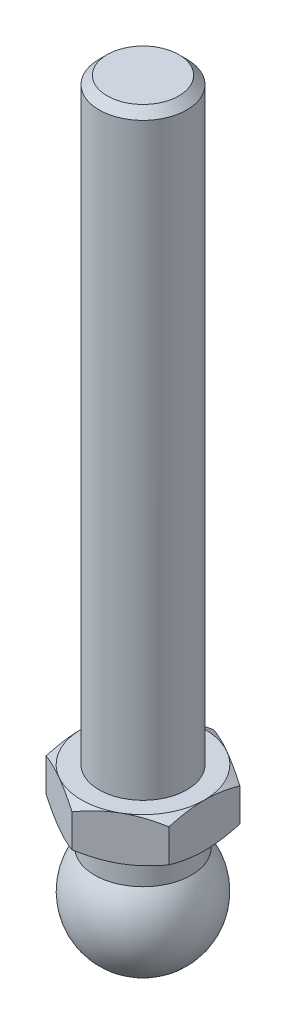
ISO-10303-21;
HEADER;
FILE_DESCRIPTION(('STEP AP214'),'2;1');
FILE_NAME('part.step','',(''),(''),'','','');
FILE_SCHEMA(('AUTOMOTIVE_DESIGN { 1 0 10303 214 1 1 1 1 }'));
ENDSEC;
DATA;
#1=APPLICATION_CONTEXT('core data for automotive mechanical design processes');
#2=APPLICATION_PROTOCOL_DEFINITION('international standard','automotive_design',2000,#1);
#3=PRODUCT_CONTEXT('',#1,'mechanical');
#4=PRODUCT('Part','Part','',(#3));
#5=PRODUCT_RELATED_PRODUCT_CATEGORY('part','',(#4));
#6=PRODUCT_DEFINITION_FORMATION('','',#4);
#7=PRODUCT_DEFINITION_CONTEXT('part definition',#1,'design');
#8=PRODUCT_DEFINITION('design','',#6,#7);
#9=PRODUCT_DEFINITION_SHAPE('','',#8);
#10=(LENGTH_UNIT() NAMED_UNIT(*) SI_UNIT(.MILLI.,.METRE.));
#11=(NAMED_UNIT(*) PLANE_ANGLE_UNIT() SI_UNIT($,.RADIAN.));
#12=(NAMED_UNIT(*) SI_UNIT($,.STERADIAN.) SOLID_ANGLE_UNIT());
#13=UNCERTAINTY_MEASURE_WITH_UNIT(LENGTH_MEASURE(1.E-05),#10,'distance_accuracy_value','');
#14=(GEOMETRIC_REPRESENTATION_CONTEXT(3) GLOBAL_UNCERTAINTY_ASSIGNED_CONTEXT((#13)) GLOBAL_UNIT_ASSIGNED_CONTEXT((#10,
#11,#12)) REPRESENTATION_CONTEXT('',''));
#15=CARTESIAN_POINT('',(0.,0.,0.));
#16=DIRECTION('',(0.,0.,1.));
#17=DIRECTION('',(1.,0.,0.));
#18=AXIS2_PLACEMENT_3D('',#15,#16,#17);
#19=CARTESIAN_POINT('',(0.,19.5,0.));
#20=DIRECTION('',(0.,-1.,0.));
#21=DIRECTION('',(0.,0.,-1.));
#22=AXIS2_PLACEMENT_3D('',#19,#20,#21);
#23=CONICAL_SURFACE('',#22,7.,1.0471975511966);
#24=CARTESIAN_POINT('',(-7.,15.2688336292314,12.5023453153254));
#25=CARTESIAN_POINT('',(-7.,15.4184696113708,12.2052647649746));
#26=CARTESIAN_POINT('',(-7.,15.5671267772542,11.9076861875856));
#27=CARTESIAN_POINT('',(-7.,15.8620076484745,11.3113035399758));
#28=CARTESIAN_POINT('',(-7.,16.0082312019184,11.0124993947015));
#29=CARTESIAN_POINT('',(-7.,16.2980281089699,10.4128982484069));
#30=CARTESIAN_POINT('',(-7.,16.441595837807,10.1120985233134));
#31=CARTESIAN_POINT('',(-7.,16.7251296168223,9.50881013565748));
#32=CARTESIAN_POINT('',(-7.,16.8650957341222,9.20632150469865));
#33=CARTESIAN_POINT('',(-7.,17.1470427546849,8.58510325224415));
#34=CARTESIAN_POINT('',(-7.,17.2888108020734,8.26627671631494));
#35=CARTESIAN_POINT('',(-7.,17.5662200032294,7.62594250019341));
#36=CARTESIAN_POINT('',(-7.,17.7018608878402,7.30443470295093));
#37=CARTESIAN_POINT('',(-7.,17.9652496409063,6.65840905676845));
#38=CARTESIAN_POINT('',(-7.,18.0930022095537,6.33389313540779));
#39=CARTESIAN_POINT('',(-7.,18.3384540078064,5.68109770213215));
#40=CARTESIAN_POINT('',(-7.,18.4561543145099,5.35281859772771));
#41=CARTESIAN_POINT('',(-7.,18.7028165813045,4.61998548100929));
#42=CARTESIAN_POINT('',(-7.,18.8286623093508,4.21436746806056));
#43=CARTESIAN_POINT('',(-7.,19.0543524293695,3.39574912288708));
#44=CARTESIAN_POINT('',(-7.,19.1541980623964,2.98274914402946));
#45=CARTESIAN_POINT('',(-7.,19.2776062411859,2.36178861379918));
#46=CARTESIAN_POINT('',(-7.,19.3141378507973,2.15638627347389));
#47=CARTESIAN_POINT('',(-7.,19.3780104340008,1.74416917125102));
#48=CARTESIAN_POINT('',(-7.,19.4053527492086,1.53735462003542));
#49=CARTESIAN_POINT('',(-7.,19.4500375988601,1.1227076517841));
#50=CARTESIAN_POINT('',(-7.,19.467383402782,0.914875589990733));
#51=CARTESIAN_POINT('',(-7.,19.4915250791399,0.498594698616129));
#52=CARTESIAN_POINT('',(-7.,19.4983210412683,0.290145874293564));
#53=CARTESIAN_POINT('',(-7.,19.5011397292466,-0.128421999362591));
#54=CARTESIAN_POINT('',(-7.,19.4970795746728,-0.338541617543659));
#55=CARTESIAN_POINT('',(-7.,19.4781521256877,-0.758289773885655));
#56=CARTESIAN_POINT('',(-7.,19.463284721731,-0.967918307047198));
#57=CARTESIAN_POINT('',(-7.,19.4232345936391,-1.38625975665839));
#58=CARTESIAN_POINT('',(-7.,19.3980479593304,-1.59497229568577));
#59=CARTESIAN_POINT('',(-7.,19.3381380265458,-2.01100790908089));
#60=CARTESIAN_POINT('',(-7.,19.3034145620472,-2.21833095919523));
#61=CARTESIAN_POINT('',(-7.,19.1849408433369,-2.84522045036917));
#62=CARTESIAN_POINT('',(-7.,19.0876569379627,-3.26225118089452));
#63=CARTESIAN_POINT('',(-7.,18.8658468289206,-4.08879182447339));
#64=CARTESIAN_POINT('',(-7.,18.7413180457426,-4.4983010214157));
#65=CARTESIAN_POINT('',(-7.,18.4953846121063,-5.2406101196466));
#66=CARTESIAN_POINT('',(-7.,18.3771372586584,-5.5744719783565));
#67=CARTESIAN_POINT('',(-7.,18.1300009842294,-6.23825206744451));
#68=CARTESIAN_POINT('',(-7.,18.0011107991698,-6.56816982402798));
#69=CARTESIAN_POINT('',(-7.,17.7350197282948,-7.22486424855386));
#70=CARTESIAN_POINT('',(-7.,17.5978135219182,-7.55163874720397));
#71=CARTESIAN_POINT('',(-7.,17.3169731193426,-8.20238370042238));
#72=CARTESIAN_POINT('',(-7.,17.1733392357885,-8.5263542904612));
#73=CARTESIAN_POINT('',(-7.,16.8876445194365,-9.15729037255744));
#74=CARTESIAN_POINT('',(-7.,16.7458097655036,-9.46435857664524));
#75=CARTESIAN_POINT('',(-7.,16.4583976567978,-10.0767426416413));
#76=CARTESIAN_POINT('',(-7.,16.3128202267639,-10.3820584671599));
#77=CARTESIAN_POINT('',(-7.,16.018926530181,-10.990585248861));
#78=CARTESIAN_POINT('',(-7.,15.8706165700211,-11.2937992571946));
#79=CARTESIAN_POINT('',(-7.,15.5714843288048,-11.8989613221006));
#80=CARTESIAN_POINT('',(-7.,15.4206622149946,-12.2009094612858));
#81=CARTESIAN_POINT('',(-7.,15.2688336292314,-12.5023453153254));
#82=B_SPLINE_CURVE_WITH_KNOTS('',3,(#24,#25,#26,#27,#28,#29,#30,#31,#32,#33,#34,#35,#36,#37,#38,
#39,#40,#41,#42,#43,#44,#45,#46,#47,#48,#49,#50,#51,#52,#53,#54,#55,#56,#57,#58,#59,#60,#61,#62,
#63,#64,#65,#66,#67,#68,#69,#70,#71,#72,#73,#74,#75,#76,#77,#78,#79,#80,#81),.UNSPECIFIED.,.F.,
.F.,(4,2,2,2,2,2,2,2,2,2,2,2,2,2,2,2,2,2,2,2,2,2,2,2,2,2,2,2,4),(0.,0.997917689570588,
1.99589743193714,2.99579247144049,3.99566886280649,5.04239250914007,6.08916209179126,
7.13530182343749,8.18132932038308,9.45480706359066,10.7282240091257,11.3539282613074,
11.9795411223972,12.6049492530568,13.2303520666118,13.8605430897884,14.490740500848,
15.1211769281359,15.7516243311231,17.0349275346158,18.3183522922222,19.380686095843,
20.4431462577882,21.506293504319,22.5693890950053,23.5840866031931,24.5988045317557,
25.6114179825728,26.6239642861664),.UNSPECIFIED.);
#83=CARTESIAN_POINT('',(-7.,18.8747852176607,4.04145188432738));
#84=VERTEX_POINT('',#83);
#85=CARTESIAN_POINT('',(-7.,19.5,0.));
#86=VERTEX_POINT('',#85);
#87=EDGE_CURVE('E359',#84,#86,#82,.T.);
#88=ORIENTED_EDGE('',*,*,#87,.F.);
#89=CARTESIAN_POINT('',(0.0002,18.8747185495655,8.0830192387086));
#90=CARTESIAN_POINT('',(-0.153667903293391,18.9260001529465,7.99418356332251));
#91=CARTESIAN_POINT('',(-0.30810950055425,18.9749544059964,7.90501666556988));
#92=CARTESIAN_POINT('',(-0.618246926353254,19.0675672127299,7.72595873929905));
#93=CARTESIAN_POINT('',(-0.773943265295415,19.1112234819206,7.63606741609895));
#94=CARTESIAN_POINT('',(-1.24352516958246,19.2333884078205,7.36495417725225));
#95=CARTESIAN_POINT('',(-1.5592643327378,19.302874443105,7.18266208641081));
#96=CARTESIAN_POINT('',(-2.03176224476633,19.3843550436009,6.9098652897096));
#97=CARTESIAN_POINT('',(-2.18710922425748,19.4075665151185,6.82017566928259));
#98=CARTESIAN_POINT('',(-2.49850511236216,19.4464887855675,6.64039116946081));
#99=CARTESIAN_POINT('',(-2.65455395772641,19.4622002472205,6.55029632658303));
#100=CARTESIAN_POINT('',(-2.96692267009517,19.4857220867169,6.36995016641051));
#101=CARTESIAN_POINT('',(-3.12324202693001,19.4935414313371,6.27969914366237));
#102=CARTESIAN_POINT('',(-3.43601650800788,19.5011197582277,6.09911871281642));
#103=CARTESIAN_POINT('',(-3.59247162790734,19.500878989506,6.00878930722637));
#104=CARTESIAN_POINT('',(-4.02110687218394,19.4891402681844,5.76131663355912));
#105=CARTESIAN_POINT('',(-4.2931466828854,19.4694342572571,5.60425437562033));
#106=CARTESIAN_POINT('',(-4.83541944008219,19.4069465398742,5.29117305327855));
#107=CARTESIAN_POINT('',(-5.10565047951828,19.364143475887,5.13515508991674));
#108=CARTESIAN_POINT('',(-5.64901454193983,19.2571483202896,4.82144370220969));
#109=CARTESIAN_POINT('',(-5.92207900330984,19.1925029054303,4.66378986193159));
#110=CARTESIAN_POINT('',(-6.46413578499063,19.045783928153,4.35083323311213));
#111=CARTESIAN_POINT('',(-6.73313504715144,18.9637448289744,4.19552643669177));
#112=CARTESIAN_POINT('',(-7.0002,18.8747185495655,4.04133641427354));
#113=B_SPLINE_CURVE_WITH_KNOTS('',3,(#89,#90,#91,#92,#93,#94,#95,#96,#97,#98,#99,#100,#101,#102,
#103,#104,#105,#106,#107,#108,#109,#110,#111,#112),.UNSPECIFIED.,.F.,.F.,(4,2,2,2,2,2,2,2,2,2,2,
4),(0.,0.554727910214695,1.10969417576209,2.2219327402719,2.76443041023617,3.30688013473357,
3.8487128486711,4.39052882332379,5.33376515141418,6.27787517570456,7.2429241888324,
8.20607866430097),.UNSPECIFIED.);
#114=CARTESIAN_POINT('',(-3.5,19.5,6.06217782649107));
#115=VERTEX_POINT('',#114);
#116=EDGE_CURVE('E148',#115,#84,#113,.T.);
#117=ORIENTED_EDGE('',*,*,#116,.F.);
#118=CARTESIAN_POINT('',(0.,19.5,0.));
#119=DIRECTION('',(0.,-1.,0.));
#120=DIRECTION('',(0.,0.,-1.));
#121=AXIS2_PLACEMENT_3D('',#118,#119,#120);
#122=CIRCLE('',#121,7.);
#123=EDGE_CURVE('E317',#115,#86,#122,.T.);
#124=ORIENTED_EDGE('',*,*,#123,.T.);
#125=EDGE_LOOP('',(#88,#117,#124));
#126=FACE_BOUND('',#125,.T.);
#127=ADVANCED_FACE('F18',(#126),#23,.T.);
#128=CARTESIAN_POINT('',(-7.,18.8747852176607,-4.04145188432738));
#129=VERTEX_POINT('',#128);
#130=EDGE_CURVE('E213',#86,#129,#82,.T.);
#131=ORIENTED_EDGE('',*,*,#130,.F.);
#132=CARTESIAN_POINT('',(-3.5,19.5,-6.06217782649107));
#133=VERTEX_POINT('',#132);
#134=EDGE_CURVE('E340',#86,#133,#122,.T.);
#135=ORIENTED_EDGE('',*,*,#134,.T.);
#136=CARTESIAN_POINT('',(-7.0002,18.8747185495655,-4.04133641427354));
#137=CARTESIAN_POINT('',(-6.84633209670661,18.9260001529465,-4.13017208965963));
#138=CARTESIAN_POINT('',(-6.69189049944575,18.9749544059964,-4.21933898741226));
#139=CARTESIAN_POINT('',(-6.38175307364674,19.0675672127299,-4.39839691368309));
#140=CARTESIAN_POINT('',(-6.22605673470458,19.1112234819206,-4.48828823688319));
#141=CARTESIAN_POINT('',(-5.75647483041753,19.2333884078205,-4.75940147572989));
#142=CARTESIAN_POINT('',(-5.4407356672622,19.302874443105,-4.94169356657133));
#143=CARTESIAN_POINT('',(-4.96823775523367,19.3843550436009,-5.21449036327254));
#144=CARTESIAN_POINT('',(-4.81289077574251,19.4075665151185,-5.30417998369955));
#145=CARTESIAN_POINT('',(-4.50149488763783,19.4464887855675,-5.48396448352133));
#146=CARTESIAN_POINT('',(-4.34544604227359,19.4622002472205,-5.57405932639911));
#147=CARTESIAN_POINT('',(-4.03307732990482,19.4857220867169,-5.75440548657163));
#148=CARTESIAN_POINT('',(-3.87675797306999,19.4935414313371,-5.84465650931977));
#149=CARTESIAN_POINT('',(-3.56398349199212,19.5011197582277,-6.02523694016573));
#150=CARTESIAN_POINT('',(-3.40752837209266,19.500878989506,-6.11556634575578));
#151=CARTESIAN_POINT('',(-2.97889312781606,19.4891402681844,-6.36303901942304));
#152=CARTESIAN_POINT('',(-2.7068533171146,19.4694342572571,-6.52010127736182));
#153=CARTESIAN_POINT('',(-2.1645805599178,19.4069465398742,-6.83318259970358));
#154=CARTESIAN_POINT('',(-1.89434952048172,19.364143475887,-6.9892005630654));
#155=CARTESIAN_POINT('',(-1.35098545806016,19.2571483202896,-7.30291195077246));
#156=CARTESIAN_POINT('',(-1.07792099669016,19.1925029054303,-7.46056579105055));
#157=CARTESIAN_POINT('',(-0.53586421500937,19.045783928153,-7.77352241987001));
#158=CARTESIAN_POINT('',(-0.26686495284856,18.9637448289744,-7.92882921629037));
#159=CARTESIAN_POINT('',(0.000200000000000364,18.8747185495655,-8.0830192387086));
#160=B_SPLINE_CURVE_WITH_KNOTS('',3,(#136,#137,#138,#139,#140,#141,#142,#143,#144,#145,#146,
#147,#148,#149,#150,#151,#152,#153,#154,#155,#156,#157,#158,#159),.UNSPECIFIED.,.F.,.F.,(4,2,2,
2,2,2,2,2,2,2,2,4),(0.,0.554727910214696,1.10969417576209,2.2219327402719,2.76443041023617,
3.30688013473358,3.8487128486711,4.39052882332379,5.33376515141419,6.27787517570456,
7.2429241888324,8.20607866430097),.UNSPECIFIED.);
#161=EDGE_CURVE('E205',#129,#133,#160,.T.);
#162=ORIENTED_EDGE('',*,*,#161,.F.);
#163=EDGE_LOOP('',(#131,#135,#162));
#164=FACE_BOUND('',#163,.T.);
#165=ADVANCED_FACE('F406',(#164),#23,.T.);
#166=CARTESIAN_POINT('',(0.,18.8747852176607,-8.08290376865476));
#167=VERTEX_POINT('',#166);
#168=EDGE_CURVE('E206',#133,#167,#160,.T.);
#169=ORIENTED_EDGE('',*,*,#168,.F.);
#170=CARTESIAN_POINT('',(3.5,19.5,-6.06217782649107));
#171=VERTEX_POINT('',#170);
#172=EDGE_CURVE('E331',#133,#171,#122,.T.);
#173=ORIENTED_EDGE('',*,*,#172,.T.);
#174=CARTESIAN_POINT('',(-0.0002,18.8747185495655,-8.0830192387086));
#175=CARTESIAN_POINT('',(0.153667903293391,18.9260001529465,-7.99418356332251));
#176=CARTESIAN_POINT('',(0.30810950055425,18.9749544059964,-7.90501666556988));
#177=CARTESIAN_POINT('',(0.618246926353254,19.0675672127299,-7.72595873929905));
#178=CARTESIAN_POINT('',(0.773943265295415,19.1112234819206,-7.63606741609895));
#179=CARTESIAN_POINT('',(1.24352516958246,19.2333884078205,-7.36495417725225));
#180=CARTESIAN_POINT('',(1.5592643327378,19.302874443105,-7.18266208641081));
#181=CARTESIAN_POINT('',(2.03176224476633,19.3843550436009,-6.9098652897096));
#182=CARTESIAN_POINT('',(2.18710922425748,19.4075665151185,-6.82017566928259));
#183=CARTESIAN_POINT('',(2.49850511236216,19.4464887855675,-6.64039116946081));
#184=CARTESIAN_POINT('',(2.65455395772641,19.4622002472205,-6.55029632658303));
#185=CARTESIAN_POINT('',(2.96692267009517,19.4857220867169,-6.36995016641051));
#186=CARTESIAN_POINT('',(3.12324202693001,19.4935414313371,-6.27969914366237));
#187=CARTESIAN_POINT('',(3.43601650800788,19.5011197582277,-6.09911871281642));
#188=CARTESIAN_POINT('',(3.59247162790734,19.500878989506,-6.00878930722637));
#189=CARTESIAN_POINT('',(4.02110687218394,19.4891402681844,-5.76131663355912));
#190=CARTESIAN_POINT('',(4.2931466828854,19.4694342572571,-5.60425437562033));
#191=CARTESIAN_POINT('',(4.83541944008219,19.4069465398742,-5.29117305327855));
#192=CARTESIAN_POINT('',(5.10565047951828,19.364143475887,-5.13515508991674));
#193=CARTESIAN_POINT('',(5.64901454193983,19.2571483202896,-4.82144370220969));
#194=CARTESIAN_POINT('',(5.92207900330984,19.1925029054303,-4.66378986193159));
#195=CARTESIAN_POINT('',(6.46413578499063,19.045783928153,-4.35083323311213));
#196=CARTESIAN_POINT('',(6.73313504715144,18.9637448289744,-4.19552643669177));
#197=CARTESIAN_POINT('',(7.0002,18.8747185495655,-4.04133641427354));
#198=B_SPLINE_CURVE_WITH_KNOTS('',3,(#174,#175,#176,#177,#178,#179,#180,#181,#182,#183,#184,
#185,#186,#187,#188,#189,#190,#191,#192,#193,#194,#195,#196,#197),.UNSPECIFIED.,.F.,.F.,(4,2,2,
2,2,2,2,2,2,2,2,4),(0.,0.554727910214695,1.10969417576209,2.2219327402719,2.76443041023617,
3.30688013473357,3.8487128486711,4.39052882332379,5.33376515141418,6.27787517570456,
7.2429241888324,8.20607866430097),.UNSPECIFIED.);
#199=EDGE_CURVE('E247',#167,#171,#198,.T.);
#200=ORIENTED_EDGE('',*,*,#199,.F.);
#201=EDGE_LOOP('',(#169,#173,#200));
#202=FACE_BOUND('',#201,.T.);
#203=ADVANCED_FACE('F412',(#202),#23,.T.);
#204=CARTESIAN_POINT('',(7.,18.8747852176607,-4.04145188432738));
#205=VERTEX_POINT('',#204);
#206=EDGE_CURVE('E248',#171,#205,#198,.T.);
#207=ORIENTED_EDGE('',*,*,#206,.F.);
#208=CARTESIAN_POINT('',(7.,19.5,0.));
#209=VERTEX_POINT('',#208);
#210=EDGE_CURVE('E324',#171,#209,#122,.T.);
#211=ORIENTED_EDGE('',*,*,#210,.T.);
#212=CARTESIAN_POINT('',(7.,15.2688336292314,-12.5023453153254));
#213=CARTESIAN_POINT('',(7.,15.4184696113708,-12.2052647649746));
#214=CARTESIAN_POINT('',(7.,15.5671267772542,-11.9076861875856));
#215=CARTESIAN_POINT('',(7.,15.8620076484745,-11.3113035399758));
#216=CARTESIAN_POINT('',(7.,16.0082312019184,-11.0124993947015));
#217=CARTESIAN_POINT('',(7.,16.2980281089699,-10.4128982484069));
#218=CARTESIAN_POINT('',(7.,16.441595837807,-10.1120985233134));
#219=CARTESIAN_POINT('',(7.,16.7251296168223,-9.50881013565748));
#220=CARTESIAN_POINT('',(7.,16.8650957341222,-9.20632150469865));
#221=CARTESIAN_POINT('',(7.,17.1470427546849,-8.58510325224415));
#222=CARTESIAN_POINT('',(7.,17.2888108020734,-8.26627671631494));
#223=CARTESIAN_POINT('',(7.,17.5662200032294,-7.62594250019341));
#224=CARTESIAN_POINT('',(7.,17.7018608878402,-7.30443470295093));
#225=CARTESIAN_POINT('',(7.,17.9652496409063,-6.65840905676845));
#226=CARTESIAN_POINT('',(7.,18.0930022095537,-6.33389313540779));
#227=CARTESIAN_POINT('',(7.,18.3384540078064,-5.68109770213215));
#228=CARTESIAN_POINT('',(7.,18.4561543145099,-5.35281859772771));
#229=CARTESIAN_POINT('',(7.,18.7028165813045,-4.61998548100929));
#230=CARTESIAN_POINT('',(7.,18.8286623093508,-4.21436746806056));
#231=CARTESIAN_POINT('',(7.,19.0543524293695,-3.39574912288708));
#232=CARTESIAN_POINT('',(7.,19.1541980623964,-2.98274914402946));
#233=CARTESIAN_POINT('',(7.,19.2776062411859,-2.36178861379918));
#234=CARTESIAN_POINT('',(7.,19.3141378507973,-2.15638627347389));
#235=CARTESIAN_POINT('',(7.,19.3780104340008,-1.74416917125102));
#236=CARTESIAN_POINT('',(7.,19.4053527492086,-1.53735462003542));
#237=CARTESIAN_POINT('',(7.,19.4500375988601,-1.1227076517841));
#238=CARTESIAN_POINT('',(7.,19.467383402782,-0.914875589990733));
#239=CARTESIAN_POINT('',(7.,19.4915250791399,-0.498594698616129));
#240=CARTESIAN_POINT('',(7.,19.4983210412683,-0.290145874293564));
#241=CARTESIAN_POINT('',(7.,19.5011397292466,0.128421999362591));
#242=CARTESIAN_POINT('',(7.,19.4970795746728,0.338541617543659));
#243=CARTESIAN_POINT('',(7.,19.4781521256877,0.758289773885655));
#244=CARTESIAN_POINT('',(7.,19.463284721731,0.967918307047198));
#245=CARTESIAN_POINT('',(7.,19.4232345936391,1.38625975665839));
#246=CARTESIAN_POINT('',(7.,19.3980479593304,1.59497229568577));
#247=CARTESIAN_POINT('',(7.,19.3381380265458,2.01100790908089));
#248=CARTESIAN_POINT('',(7.,19.3034145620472,2.21833095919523));
#249=CARTESIAN_POINT('',(7.,19.1849408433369,2.84522045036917));
#250=CARTESIAN_POINT('',(7.,19.0876569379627,3.26225118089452));
#251=CARTESIAN_POINT('',(7.,18.8658468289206,4.08879182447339));
#252=CARTESIAN_POINT('',(7.,18.7413180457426,4.4983010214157));
#253=CARTESIAN_POINT('',(7.,18.4953846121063,5.2406101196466));
#254=CARTESIAN_POINT('',(7.,18.3771372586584,5.5744719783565));
#255=CARTESIAN_POINT('',(7.,18.1300009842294,6.23825206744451));
#256=CARTESIAN_POINT('',(7.,18.0011107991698,6.56816982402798));
#257=CARTESIAN_POINT('',(7.,17.7350197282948,7.22486424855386));
#258=CARTESIAN_POINT('',(7.,17.5978135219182,7.55163874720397));
#259=CARTESIAN_POINT('',(7.,17.3169731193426,8.20238370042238));
#260=CARTESIAN_POINT('',(7.,17.1733392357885,8.5263542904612));
#261=CARTESIAN_POINT('',(7.,16.8876445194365,9.15729037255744));
#262=CARTESIAN_POINT('',(7.,16.7458097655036,9.46435857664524));
#263=CARTESIAN_POINT('',(7.,16.4583976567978,10.0767426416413));
#264=CARTESIAN_POINT('',(7.,16.3128202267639,10.3820584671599));
#265=CARTESIAN_POINT('',(7.,16.018926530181,10.990585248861));
#266=CARTESIAN_POINT('',(7.,15.8706165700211,11.2937992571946));
#267=CARTESIAN_POINT('',(7.,15.5714843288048,11.8989613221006));
#268=CARTESIAN_POINT('',(7.,15.4206622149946,12.2009094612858));
#269=CARTESIAN_POINT('',(7.,15.2688336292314,12.5023453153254));
#270=B_SPLINE_CURVE_WITH_KNOTS('',3,(#212,#213,#214,#215,#216,#217,#218,#219,#220,#221,#222,
#223,#224,#225,#226,#227,#228,#229,#230,#231,#232,#233,#234,#235,#236,#237,#238,#239,#240,#241,
#242,#243,#244,#245,#246,#247,#248,#249,#250,#251,#252,#253,#254,#255,#256,#257,#258,#259,#260,
#261,#262,#263,#264,#265,#266,#267,#268,#269),.UNSPECIFIED.,.F.,.F.,(4,2,2,2,2,2,2,2,2,2,2,2,2,
2,2,2,2,2,2,2,2,2,2,2,2,2,2,2,4),(0.,0.997917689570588,1.99589743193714,2.99579247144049,
3.99566886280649,5.04239250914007,6.08916209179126,7.13530182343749,8.18132932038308,
9.45480706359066,10.7282240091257,11.3539282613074,11.9795411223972,12.6049492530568,
13.2303520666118,13.8605430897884,14.490740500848,15.1211769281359,15.7516243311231,
17.0349275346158,18.3183522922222,19.380686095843,20.4431462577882,21.506293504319,
22.5693890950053,23.5840866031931,24.5988045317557,25.6114179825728,26.6239642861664),.UNSPECIFIED.);
#271=EDGE_CURVE('E270',#205,#209,#270,.T.);
#272=ORIENTED_EDGE('',*,*,#271,.F.);
#273=EDGE_LOOP('',(#207,#211,#272));
#274=FACE_BOUND('',#273,.T.);
#275=ADVANCED_FACE('F422',(#274),#23,.T.);
#276=CARTESIAN_POINT('',(7.,18.8747852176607,4.04145188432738));
#277=VERTEX_POINT('',#276);
#278=EDGE_CURVE('E271',#209,#277,#270,.T.);
#279=ORIENTED_EDGE('',*,*,#278,.F.);
#280=CARTESIAN_POINT('',(3.5,19.5,6.06217782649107));
#281=VERTEX_POINT('',#280);
#282=EDGE_CURVE('E314',#209,#281,#122,.T.);
#283=ORIENTED_EDGE('',*,*,#282,.T.);
#284=CARTESIAN_POINT('',(7.0002,18.8747185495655,4.04133641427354));
#285=CARTESIAN_POINT('',(6.84633209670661,18.9260001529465,4.13017208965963));
#286=CARTESIAN_POINT('',(6.69189049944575,18.9749544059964,4.21933898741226));
#287=CARTESIAN_POINT('',(6.38175307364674,19.0675672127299,4.39839691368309));
#288=CARTESIAN_POINT('',(6.22605673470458,19.1112234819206,4.48828823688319));
#289=CARTESIAN_POINT('',(5.75647483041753,19.2333884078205,4.75940147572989));
#290=CARTESIAN_POINT('',(5.4407356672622,19.302874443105,4.94169356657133));
#291=CARTESIAN_POINT('',(4.96823775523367,19.3843550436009,5.21449036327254));
#292=CARTESIAN_POINT('',(4.81289077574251,19.4075665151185,5.30417998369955));
#293=CARTESIAN_POINT('',(4.50149488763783,19.4464887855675,5.48396448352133));
#294=CARTESIAN_POINT('',(4.34544604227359,19.4622002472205,5.57405932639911));
#295=CARTESIAN_POINT('',(4.03307732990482,19.4857220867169,5.75440548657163));
#296=CARTESIAN_POINT('',(3.87675797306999,19.4935414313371,5.84465650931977));
#297=CARTESIAN_POINT('',(3.56398349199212,19.5011197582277,6.02523694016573));
#298=CARTESIAN_POINT('',(3.40752837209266,19.500878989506,6.11556634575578));
#299=CARTESIAN_POINT('',(2.97889312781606,19.4891402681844,6.36303901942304));
#300=CARTESIAN_POINT('',(2.7068533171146,19.4694342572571,6.52010127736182));
#301=CARTESIAN_POINT('',(2.1645805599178,19.4069465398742,6.83318259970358));
#302=CARTESIAN_POINT('',(1.89434952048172,19.364143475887,6.9892005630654));
#303=CARTESIAN_POINT('',(1.35098545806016,19.2571483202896,7.30291195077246));
#304=CARTESIAN_POINT('',(1.07792099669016,19.1925029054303,7.46056579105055));
#305=CARTESIAN_POINT('',(0.53586421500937,19.045783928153,7.77352241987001));
#306=CARTESIAN_POINT('',(0.26686495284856,18.9637448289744,7.92882921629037));
#307=CARTESIAN_POINT('',(-0.000200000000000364,18.8747185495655,8.0830192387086));
#308=B_SPLINE_CURVE_WITH_KNOTS('',3,(#284,#285,#286,#287,#288,#289,#290,#291,#292,#293,#294,
#295,#296,#297,#298,#299,#300,#301,#302,#303,#304,#305,#306,#307),.UNSPECIFIED.,.F.,.F.,(4,2,2,
2,2,2,2,2,2,2,2,4),(0.,0.554727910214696,1.10969417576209,2.2219327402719,2.76443041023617,
3.30688013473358,3.8487128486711,4.39052882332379,5.33376515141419,6.27787517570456,
7.2429241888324,8.20607866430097),.UNSPECIFIED.);
#309=EDGE_CURVE('E138',#277,#281,#308,.T.);
#310=ORIENTED_EDGE('',*,*,#309,.F.);
#311=EDGE_LOOP('',(#279,#283,#310));
#312=FACE_BOUND('',#311,.T.);
#313=ADVANCED_FACE('F320',(#312),#23,.T.);
#314=CARTESIAN_POINT('',(0.,18.8747852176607,8.08290376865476));
#315=VERTEX_POINT('',#314);
#316=EDGE_CURVE('E122',#281,#315,#308,.T.);
#317=ORIENTED_EDGE('',*,*,#316,.F.);
#318=EDGE_CURVE('E309',#281,#115,#122,.T.);
#319=ORIENTED_EDGE('',*,*,#318,.T.);
#320=EDGE_CURVE('E34',#315,#115,#113,.T.);
#321=ORIENTED_EDGE('',*,*,#320,.F.);
#322=EDGE_LOOP('',(#317,#319,#321));
#323=FACE_BOUND('',#322,.T.);
#324=ADVANCED_FACE('F308',(#323),#23,.T.);
#325=CARTESIAN_POINT('',(5.,19.5,0.));
#326=DIRECTION('',(0.,-1.,0.));
#327=DIRECTION('',(0.,0.,-1.));
#328=AXIS2_PLACEMENT_3D('',#325,#326,#327);
#329=PLANE('',#328);
#330=CARTESIAN_POINT('',(0.,19.5,0.));
#331=DIRECTION('',(0.,-1.,0.));
#332=DIRECTION('',(0.,0.,-1.));
#333=AXIS2_PLACEMENT_3D('',#330,#331,#332);
#334=CIRCLE('',#333,5.);
#335=CARTESIAN_POINT('',(0.,19.5,-5.));
#336=VERTEX_POINT('',#335);
#337=EDGE_CURVE('E323',#336,#336,#334,.F.);
#338=ORIENTED_EDGE('',*,*,#337,.F.);
#339=EDGE_LOOP('',(#338));
#340=FACE_BOUND('',#339,.T.);
#341=ORIENTED_EDGE('',*,*,#282,.F.);
#342=ORIENTED_EDGE('',*,*,#210,.F.);
#343=ORIENTED_EDGE('',*,*,#172,.F.);
#344=ORIENTED_EDGE('',*,*,#134,.F.);
#345=ORIENTED_EDGE('',*,*,#123,.F.);
#346=ORIENTED_EDGE('',*,*,#318,.F.);
#347=EDGE_LOOP('',(#341,#342,#343,#344,#345,#346));
#348=FACE_BOUND('',#347,.T.);
#349=ADVANCED_FACE('F227',(#340,#348),#329,.F.);
#350=CARTESIAN_POINT('',(-7.,14.3,-4.04145188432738));
#351=DIRECTION('',(-1.,0.,0.));
#352=DIRECTION('',(0.,0.,1.));
#353=AXIS2_PLACEMENT_3D('',#350,#351,#352);
#354=PLANE('',#353);
#355=ORIENTED_EDGE('',*,*,#87,.T.);
#356=ORIENTED_EDGE('',*,*,#130,.T.);
#357=DIRECTION('',(0.,1.,0.));
#358=VECTOR('',#357,1.);
#359=CARTESIAN_POINT('',(-7.,14.3,-4.04145188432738));
#360=LINE('',#359,#358);
#361=CARTESIAN_POINT('',(-7.,15.1252147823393,-4.04145188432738));
#362=VERTEX_POINT('',#361);
#363=EDGE_CURVE('E115',#362,#129,#360,.T.);
#364=ORIENTED_EDGE('',*,*,#363,.F.);
#365=CARTESIAN_POINT('',(-7.,18.7311663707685,-12.5023453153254));
#366=CARTESIAN_POINT('',(-7.,18.5815303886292,-12.2052647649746));
#367=CARTESIAN_POINT('',(-7.,18.4328732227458,-11.9076861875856));
#368=CARTESIAN_POINT('',(-7.,18.1379923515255,-11.3113035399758));
#369=CARTESIAN_POINT('',(-7.,17.9917687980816,-11.0124993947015));
#370=CARTESIAN_POINT('',(-7.,17.7019718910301,-10.4128982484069));
#371=CARTESIAN_POINT('',(-7.,17.558404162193,-10.1120985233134));
#372=CARTESIAN_POINT('',(-7.,17.2748703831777,-9.50881013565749));
#373=CARTESIAN_POINT('',(-7.,17.1349042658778,-9.20632150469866));
#374=CARTESIAN_POINT('',(-7.,16.8529572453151,-8.58510325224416));
#375=CARTESIAN_POINT('',(-7.,16.7111891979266,-8.26627671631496));
#376=CARTESIAN_POINT('',(-7.,16.4337799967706,-7.62594250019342));
#377=CARTESIAN_POINT('',(-7.,16.2981391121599,-7.30443470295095));
#378=CARTESIAN_POINT('',(-7.,16.0347503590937,-6.65840905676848));
#379=CARTESIAN_POINT('',(-7.,15.9069977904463,-6.33389313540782));
#380=CARTESIAN_POINT('',(-7.,15.6615459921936,-5.68109770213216));
#381=CARTESIAN_POINT('',(-7.,15.5438456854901,-5.35281859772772));
#382=CARTESIAN_POINT('',(-7.,15.2971834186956,-4.6199854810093));
#383=CARTESIAN_POINT('',(-7.,15.1713376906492,-4.21436746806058));
#384=CARTESIAN_POINT('',(-7.,14.9456475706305,-3.39574912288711));
#385=CARTESIAN_POINT('',(-7.,14.8458019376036,-2.98274914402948));
#386=CARTESIAN_POINT('',(-7.,14.7223937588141,-2.3617886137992));
#387=CARTESIAN_POINT('',(-7.,14.6858621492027,-2.1563862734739));
#388=CARTESIAN_POINT('',(-7.,14.6219895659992,-1.74416917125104));
#389=CARTESIAN_POINT('',(-7.,14.5946472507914,-1.53735462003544));
#390=CARTESIAN_POINT('',(-7.,14.5499624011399,-1.12270765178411));
#391=CARTESIAN_POINT('',(-7.,14.532616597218,-0.914875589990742));
#392=CARTESIAN_POINT('',(-7.,14.5084749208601,-0.498594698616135));
#393=CARTESIAN_POINT('',(-7.,14.5016789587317,-0.290145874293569));
#394=CARTESIAN_POINT('',(-7.,14.4988602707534,0.128421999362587));
#395=CARTESIAN_POINT('',(-7.,14.5029204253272,0.338541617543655));
#396=CARTESIAN_POINT('',(-7.,14.5218478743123,0.758289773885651));
#397=CARTESIAN_POINT('',(-7.,14.5367152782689,0.967918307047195));
#398=CARTESIAN_POINT('',(-7.,14.5767654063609,1.38625975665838));
#399=CARTESIAN_POINT('',(-7.,14.6019520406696,1.59497229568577));
#400=CARTESIAN_POINT('',(-7.,14.6618619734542,2.01100790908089));
#401=CARTESIAN_POINT('',(-7.,14.6965854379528,2.21833095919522));
#402=CARTESIAN_POINT('',(-7.,14.8150591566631,2.84522045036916));
#403=CARTESIAN_POINT('',(-7.,14.9123430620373,3.26225118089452));
#404=CARTESIAN_POINT('',(-7.,15.1341531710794,4.08879182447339));
#405=CARTESIAN_POINT('',(-7.,15.2586819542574,4.4983010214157));
#406=CARTESIAN_POINT('',(-7.,15.5046153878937,5.2406101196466));
#407=CARTESIAN_POINT('',(-7.,15.6228627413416,5.5744719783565));
#408=CARTESIAN_POINT('',(-7.,15.8699990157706,6.23825206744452));
#409=CARTESIAN_POINT('',(-7.,15.9988892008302,6.56816982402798));
#410=CARTESIAN_POINT('',(-7.,16.2649802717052,7.22486424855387));
#411=CARTESIAN_POINT('',(-7.,16.4021864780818,7.55163874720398));
#412=CARTESIAN_POINT('',(-7.,16.6830268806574,8.20238370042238));
#413=CARTESIAN_POINT('',(-7.,16.8266607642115,8.5263542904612));
#414=CARTESIAN_POINT('',(-7.,17.1123554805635,9.15729037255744));
#415=CARTESIAN_POINT('',(-7.,17.2541902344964,9.46435857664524));
#416=CARTESIAN_POINT('',(-7.,17.5416023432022,10.0767426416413));
#417=CARTESIAN_POINT('',(-7.,17.6871797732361,10.38205846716));
#418=CARTESIAN_POINT('',(-7.,17.981073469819,10.990585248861));
#419=CARTESIAN_POINT('',(-7.,18.1293834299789,11.2937992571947));
#420=CARTESIAN_POINT('',(-7.,18.4285156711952,11.8989613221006));
#421=CARTESIAN_POINT('',(-7.,18.5793377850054,12.2009094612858));
#422=CARTESIAN_POINT('',(-7.,18.7311663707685,12.5023453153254));
#423=B_SPLINE_CURVE_WITH_KNOTS('',3,(#365,#366,#367,#368,#369,#370,#371,#372,#373,#374,#375,
#376,#377,#378,#379,#380,#381,#382,#383,#384,#385,#386,#387,#388,#389,#390,#391,#392,#393,#394,
#395,#396,#397,#398,#399,#400,#401,#402,#403,#404,#405,#406,#407,#408,#409,#410,#411,#412,#413,
#414,#415,#416,#417,#418,#419,#420,#421,#422),.UNSPECIFIED.,.F.,.F.,(4,2,2,2,2,2,2,2,2,2,2,2,2,
2,2,2,2,2,2,2,2,2,2,2,2,2,2,2,4),(0.,0.997917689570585,1.99589743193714,2.99579247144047,
3.99566886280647,5.04239250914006,6.08916209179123,7.13530182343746,8.18132932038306,
9.45480706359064,10.7282240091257,11.3539282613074,11.9795411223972,12.6049492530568,
13.2303520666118,13.8605430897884,14.490740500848,15.1211769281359,15.7516243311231,
17.0349275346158,18.3183522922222,19.380686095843,20.4431462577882,21.506293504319,
22.5693890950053,23.5840866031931,24.5988045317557,25.6114179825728,26.6239642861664),.UNSPECIFIED.);
#424=CARTESIAN_POINT('',(-7.,14.5,0.));
#425=VERTEX_POINT('',#424);
#426=EDGE_CURVE('E204',#362,#425,#423,.T.);
#427=ORIENTED_EDGE('',*,*,#426,.T.);
#428=CARTESIAN_POINT('',(-7.,15.1252147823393,4.04145188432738));
#429=VERTEX_POINT('',#428);
#430=EDGE_CURVE('E194',#425,#429,#423,.T.);
#431=ORIENTED_EDGE('',*,*,#430,.T.);
#432=DIRECTION('',(0.,1.,0.));
#433=VECTOR('',#432,1.);
#434=CARTESIAN_POINT('',(-7.,14.3,4.04145188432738));
#435=LINE('',#434,#433);
#436=EDGE_CURVE('E125',#429,#84,#435,.T.);
#437=ORIENTED_EDGE('',*,*,#436,.T.);
#438=EDGE_LOOP('',(#355,#356,#364,#427,#431,#437));
#439=FACE_BOUND('',#438,.T.);
#440=ADVANCED_FACE('F222',(#439),#354,.T.);
#441=CARTESIAN_POINT('',(0.,14.3,-8.08290376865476));
#442=DIRECTION('',(-0.5,0.,-0.866025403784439));
#443=DIRECTION('',(-0.866025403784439,0.,0.5));
#444=AXIS2_PLACEMENT_3D('',#441,#442,#443);
#445=PLANE('',#444);
#446=ORIENTED_EDGE('',*,*,#161,.T.);
#447=ORIENTED_EDGE('',*,*,#168,.T.);
#448=DIRECTION('',(0.,1.,0.));
#449=VECTOR('',#448,1.);
#450=CARTESIAN_POINT('',(0.,14.3,-8.08290376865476));
#451=LINE('',#450,#449);
#452=CARTESIAN_POINT('',(0.,15.1252147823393,-8.08290376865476));
#453=VERTEX_POINT('',#452);
#454=EDGE_CURVE('E446',#453,#167,#451,.T.);
#455=ORIENTED_EDGE('',*,*,#454,.F.);
#456=CARTESIAN_POINT('',(0.000200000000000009,15.1252814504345,-8.0830192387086));
#457=CARTESIAN_POINT('',(-0.153667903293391,15.0739998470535,-7.99418356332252));
#458=CARTESIAN_POINT('',(-0.30810950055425,15.0250455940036,-7.90501666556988));
#459=CARTESIAN_POINT('',(-0.618246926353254,14.9324327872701,-7.72595873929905));
#460=CARTESIAN_POINT('',(-0.773943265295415,14.8887765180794,-7.63606741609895));
#461=CARTESIAN_POINT('',(-1.24352516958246,14.7666115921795,-7.36495417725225));
#462=CARTESIAN_POINT('',(-1.5592643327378,14.697125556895,-7.18266208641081));
#463=CARTESIAN_POINT('',(-2.03176224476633,14.6156449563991,-6.9098652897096));
#464=CARTESIAN_POINT('',(-2.18710922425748,14.5924334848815,-6.82017566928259));
#465=CARTESIAN_POINT('',(-2.49850511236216,14.5535112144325,-6.64039116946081));
#466=CARTESIAN_POINT('',(-2.65455395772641,14.5377997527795,-6.55029632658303));
#467=CARTESIAN_POINT('',(-2.96692267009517,14.5142779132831,-6.36995016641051));
#468=CARTESIAN_POINT('',(-3.12324202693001,14.5064585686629,-6.27969914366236));
#469=CARTESIAN_POINT('',(-3.43601650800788,14.4988802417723,-6.09911871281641));
#470=CARTESIAN_POINT('',(-3.59247162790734,14.499121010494,-6.00878930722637));
#471=CARTESIAN_POINT('',(-4.02110687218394,14.5108597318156,-5.76131663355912));
#472=CARTESIAN_POINT('',(-4.2931466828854,14.5305657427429,-5.60425437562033));
#473=CARTESIAN_POINT('',(-4.8354194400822,14.5930534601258,-5.29117305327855));
#474=CARTESIAN_POINT('',(-5.10565047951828,14.635856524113,-5.13515508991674));
#475=CARTESIAN_POINT('',(-5.64901454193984,14.7428516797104,-4.82144370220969));
#476=CARTESIAN_POINT('',(-5.92207900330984,14.8074970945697,-4.66378986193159));
#477=CARTESIAN_POINT('',(-6.46413578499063,14.954216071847,-4.35083323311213));
#478=CARTESIAN_POINT('',(-6.73313504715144,15.0362551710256,-4.19552643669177));
#479=CARTESIAN_POINT('',(-7.0002,15.1252814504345,-4.04133641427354));
#480=B_SPLINE_CURVE_WITH_KNOTS('',3,(#456,#457,#458,#459,#460,#461,#462,#463,#464,#465,#466,
#467,#468,#469,#470,#471,#472,#473,#474,#475,#476,#477,#478,#479),.UNSPECIFIED.,.F.,.F.,(4,2,2,
2,2,2,2,2,2,2,2,4),(0.,0.554727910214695,1.10969417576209,2.2219327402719,2.76443041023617,
3.30688013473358,3.8487128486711,4.39052882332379,5.33376515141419,6.27787517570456,
7.2429241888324,8.20607866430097),.UNSPECIFIED.);
#481=CARTESIAN_POINT('',(-3.5,14.5,-6.06217782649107));
#482=VERTEX_POINT('',#481);
#483=EDGE_CURVE('E246',#453,#482,#480,.T.);
#484=ORIENTED_EDGE('',*,*,#483,.T.);
#485=EDGE_CURVE('E238',#482,#362,#480,.T.);
#486=ORIENTED_EDGE('',*,*,#485,.T.);
#487=ORIENTED_EDGE('',*,*,#363,.T.);
#488=EDGE_LOOP('',(#446,#447,#455,#484,#486,#487));
#489=FACE_BOUND('',#488,.T.);
#490=ADVANCED_FACE('F226',(#489),#445,.T.);
#491=CARTESIAN_POINT('',(7.,14.3,-4.04145188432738));
#492=DIRECTION('',(0.5,0.,-0.866025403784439));
#493=DIRECTION('',(-0.866025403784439,0.,-0.5));
#494=AXIS2_PLACEMENT_3D('',#491,#492,#493);
#495=PLANE('',#494);
#496=ORIENTED_EDGE('',*,*,#199,.T.);
#497=ORIENTED_EDGE('',*,*,#206,.T.);
#498=DIRECTION('',(0.,1.,0.));
#499=VECTOR('',#498,1.);
#500=CARTESIAN_POINT('',(7.,14.3,-4.04145188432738));
#501=LINE('',#500,#499);
#502=CARTESIAN_POINT('',(7.,15.1252147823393,-4.04145188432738));
#503=VERTEX_POINT('',#502);
#504=EDGE_CURVE('E463',#503,#205,#501,.T.);
#505=ORIENTED_EDGE('',*,*,#504,.F.);
#506=CARTESIAN_POINT('',(7.0002,15.1252814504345,-4.04133641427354));
#507=CARTESIAN_POINT('',(6.84633209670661,15.0739998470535,-4.13017208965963));
#508=CARTESIAN_POINT('',(6.69189049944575,15.0250455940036,-4.21933898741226));
#509=CARTESIAN_POINT('',(6.38175307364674,14.9324327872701,-4.39839691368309));
#510=CARTESIAN_POINT('',(6.22605673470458,14.8887765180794,-4.48828823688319));
#511=CARTESIAN_POINT('',(5.75647483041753,14.7666115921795,-4.75940147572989));
#512=CARTESIAN_POINT('',(5.4407356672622,14.697125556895,-4.94169356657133));
#513=CARTESIAN_POINT('',(4.96823775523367,14.6156449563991,-5.21449036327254));
#514=CARTESIAN_POINT('',(4.81289077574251,14.5924334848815,-5.30417998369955));
#515=CARTESIAN_POINT('',(4.50149488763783,14.5535112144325,-5.48396448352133));
#516=CARTESIAN_POINT('',(4.34544604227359,14.5377997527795,-5.57405932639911));
#517=CARTESIAN_POINT('',(4.03307732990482,14.5142779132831,-5.75440548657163));
#518=CARTESIAN_POINT('',(3.87675797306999,14.5064585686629,-5.84465650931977));
#519=CARTESIAN_POINT('',(3.56398349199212,14.4988802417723,-6.02523694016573));
#520=CARTESIAN_POINT('',(3.40752837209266,14.499121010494,-6.11556634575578));
#521=CARTESIAN_POINT('',(2.97889312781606,14.5108597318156,-6.36303901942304));
#522=CARTESIAN_POINT('',(2.7068533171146,14.5305657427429,-6.52010127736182));
#523=CARTESIAN_POINT('',(2.1645805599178,14.5930534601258,-6.83318259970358));
#524=CARTESIAN_POINT('',(1.89434952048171,14.635856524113,-6.9892005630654));
#525=CARTESIAN_POINT('',(1.35098545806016,14.7428516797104,-7.30291195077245));
#526=CARTESIAN_POINT('',(1.07792099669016,14.8074970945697,-7.46056579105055));
#527=CARTESIAN_POINT('',(0.53586421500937,14.954216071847,-7.77352241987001));
#528=CARTESIAN_POINT('',(0.266864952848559,15.0362551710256,-7.92882921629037));
#529=CARTESIAN_POINT('',(-0.000199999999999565,15.1252814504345,-8.0830192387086));
#530=B_SPLINE_CURVE_WITH_KNOTS('',3,(#506,#507,#508,#509,#510,#511,#512,#513,#514,#515,#516,
#517,#518,#519,#520,#521,#522,#523,#524,#525,#526,#527,#528,#529),.UNSPECIFIED.,.F.,.F.,(4,2,2,
2,2,2,2,2,2,2,2,4),(0.,0.554727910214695,1.10969417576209,2.2219327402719,2.76443041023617,
3.30688013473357,3.8487128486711,4.39052882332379,5.33376515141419,6.27787517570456,
7.2429241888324,8.20607866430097),.UNSPECIFIED.);
#531=CARTESIAN_POINT('',(3.5,14.5,-6.06217782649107));
#532=VERTEX_POINT('',#531);
#533=EDGE_CURVE('E269',#503,#532,#530,.T.);
#534=ORIENTED_EDGE('',*,*,#533,.T.);
#535=EDGE_CURVE('E261',#532,#453,#530,.T.);
#536=ORIENTED_EDGE('',*,*,#535,.T.);
#537=ORIENTED_EDGE('',*,*,#454,.T.);
#538=EDGE_LOOP('',(#496,#497,#505,#534,#536,#537));
#539=FACE_BOUND('',#538,.T.);
#540=ADVANCED_FACE('F234',(#539),#495,.T.);
#541=CARTESIAN_POINT('',(7.,14.3,4.04145188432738));
#542=DIRECTION('',(1.,0.,0.));
#543=DIRECTION('',(0.,0.,-1.));
#544=AXIS2_PLACEMENT_3D('',#541,#542,#543);
#545=PLANE('',#544);
#546=ORIENTED_EDGE('',*,*,#271,.T.);
#547=ORIENTED_EDGE('',*,*,#278,.T.);
#548=DIRECTION('',(0.,1.,0.));
#549=VECTOR('',#548,1.);
#550=CARTESIAN_POINT('',(7.,14.3,4.04145188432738));
#551=LINE('',#550,#549);
#552=CARTESIAN_POINT('',(7.,15.1252147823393,4.04145188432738));
#553=VERTEX_POINT('',#552);
#554=EDGE_CURVE('E124',#553,#277,#551,.T.);
#555=ORIENTED_EDGE('',*,*,#554,.F.);
#556=CARTESIAN_POINT('',(7.,18.7311663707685,12.5023453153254));
#557=CARTESIAN_POINT('',(7.,18.5815303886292,12.2052647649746));
#558=CARTESIAN_POINT('',(7.,18.4328732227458,11.9076861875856));
#559=CARTESIAN_POINT('',(7.,18.1379923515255,11.3113035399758));
#560=CARTESIAN_POINT('',(7.,17.9917687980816,11.0124993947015));
#561=CARTESIAN_POINT('',(7.,17.7019718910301,10.4128982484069));
#562=CARTESIAN_POINT('',(7.,17.558404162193,10.1120985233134));
#563=CARTESIAN_POINT('',(7.,17.2748703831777,9.50881013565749));
#564=CARTESIAN_POINT('',(7.,17.1349042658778,9.20632150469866));
#565=CARTESIAN_POINT('',(7.,16.8529572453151,8.58510325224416));
#566=CARTESIAN_POINT('',(7.,16.7111891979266,8.26627671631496));
#567=CARTESIAN_POINT('',(7.,16.4337799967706,7.62594250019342));
#568=CARTESIAN_POINT('',(7.,16.2981391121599,7.30443470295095));
#569=CARTESIAN_POINT('',(7.,16.0347503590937,6.65840905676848));
#570=CARTESIAN_POINT('',(7.,15.9069977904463,6.33389313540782));
#571=CARTESIAN_POINT('',(7.,15.6615459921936,5.68109770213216));
#572=CARTESIAN_POINT('',(7.,15.5438456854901,5.35281859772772));
#573=CARTESIAN_POINT('',(7.,15.2971834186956,4.6199854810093));
#574=CARTESIAN_POINT('',(7.,15.1713376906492,4.21436746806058));
#575=CARTESIAN_POINT('',(7.,14.9456475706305,3.39574912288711));
#576=CARTESIAN_POINT('',(7.,14.8458019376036,2.98274914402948));
#577=CARTESIAN_POINT('',(7.,14.7223937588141,2.3617886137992));
#578=CARTESIAN_POINT('',(7.,14.6858621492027,2.1563862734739));
#579=CARTESIAN_POINT('',(7.,14.6219895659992,1.74416917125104));
#580=CARTESIAN_POINT('',(7.,14.5946472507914,1.53735462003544));
#581=CARTESIAN_POINT('',(7.,14.5499624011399,1.12270765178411));
#582=CARTESIAN_POINT('',(7.,14.532616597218,0.914875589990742));
#583=CARTESIAN_POINT('',(7.,14.5084749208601,0.498594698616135));
#584=CARTESIAN_POINT('',(7.,14.5016789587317,0.290145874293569));
#585=CARTESIAN_POINT('',(7.,14.4988602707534,-0.128421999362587));
#586=CARTESIAN_POINT('',(7.,14.5029204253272,-0.338541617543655));
#587=CARTESIAN_POINT('',(7.,14.5218478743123,-0.758289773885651));
#588=CARTESIAN_POINT('',(7.,14.5367152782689,-0.967918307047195));
#589=CARTESIAN_POINT('',(7.,14.5767654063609,-1.38625975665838));
#590=CARTESIAN_POINT('',(7.,14.6019520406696,-1.59497229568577));
#591=CARTESIAN_POINT('',(7.,14.6618619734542,-2.01100790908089));
#592=CARTESIAN_POINT('',(7.,14.6965854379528,-2.21833095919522));
#593=CARTESIAN_POINT('',(7.,14.8150591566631,-2.84522045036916));
#594=CARTESIAN_POINT('',(7.,14.9123430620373,-3.26225118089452));
#595=CARTESIAN_POINT('',(7.,15.1341531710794,-4.08879182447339));
#596=CARTESIAN_POINT('',(7.,15.2586819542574,-4.4983010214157));
#597=CARTESIAN_POINT('',(7.,15.5046153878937,-5.2406101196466));
#598=CARTESIAN_POINT('',(7.,15.6228627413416,-5.5744719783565));
#599=CARTESIAN_POINT('',(7.,15.8699990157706,-6.23825206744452));
#600=CARTESIAN_POINT('',(7.,15.9988892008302,-6.56816982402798));
#601=CARTESIAN_POINT('',(7.,16.2649802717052,-7.22486424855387));
#602=CARTESIAN_POINT('',(7.,16.4021864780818,-7.55163874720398));
#603=CARTESIAN_POINT('',(7.,16.6830268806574,-8.20238370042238));
#604=CARTESIAN_POINT('',(7.,16.8266607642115,-8.5263542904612));
#605=CARTESIAN_POINT('',(7.,17.1123554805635,-9.15729037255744));
#606=CARTESIAN_POINT('',(7.,17.2541902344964,-9.46435857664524));
#607=CARTESIAN_POINT('',(7.,17.5416023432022,-10.0767426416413));
#608=CARTESIAN_POINT('',(7.,17.6871797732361,-10.38205846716));
#609=CARTESIAN_POINT('',(7.,17.981073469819,-10.990585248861));
#610=CARTESIAN_POINT('',(7.,18.1293834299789,-11.2937992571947));
#611=CARTESIAN_POINT('',(7.,18.4285156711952,-11.8989613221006));
#612=CARTESIAN_POINT('',(7.,18.5793377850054,-12.2009094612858));
#613=CARTESIAN_POINT('',(7.,18.7311663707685,-12.5023453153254));
#614=B_SPLINE_CURVE_WITH_KNOTS('',3,(#556,#557,#558,#559,#560,#561,#562,#563,#564,#565,#566,
#567,#568,#569,#570,#571,#572,#573,#574,#575,#576,#577,#578,#579,#580,#581,#582,#583,#584,#585,
#586,#587,#588,#589,#590,#591,#592,#593,#594,#595,#596,#597,#598,#599,#600,#601,#602,#603,#604,
#605,#606,#607,#608,#609,#610,#611,#612,#613),.UNSPECIFIED.,.F.,.F.,(4,2,2,2,2,2,2,2,2,2,2,2,2,
2,2,2,2,2,2,2,2,2,2,2,2,2,2,2,4),(0.,0.997917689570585,1.99589743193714,2.99579247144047,
3.99566886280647,5.04239250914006,6.08916209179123,7.13530182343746,8.18132932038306,
9.45480706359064,10.7282240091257,11.3539282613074,11.9795411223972,12.6049492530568,
13.2303520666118,13.8605430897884,14.490740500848,15.1211769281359,15.7516243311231,
17.0349275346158,18.3183522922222,19.380686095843,20.4431462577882,21.506293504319,
22.5693890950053,23.5840866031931,24.5988045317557,25.6114179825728,26.6239642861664),.UNSPECIFIED.);
#615=CARTESIAN_POINT('',(7.,14.5,0.));
#616=VERTEX_POINT('',#615);
#617=EDGE_CURVE('E289',#553,#616,#614,.T.);
#618=ORIENTED_EDGE('',*,*,#617,.T.);
#619=EDGE_CURVE('E282',#616,#503,#614,.T.);
#620=ORIENTED_EDGE('',*,*,#619,.T.);
#621=ORIENTED_EDGE('',*,*,#504,.T.);
#622=EDGE_LOOP('',(#546,#547,#555,#618,#620,#621));
#623=FACE_BOUND('',#622,.T.);
#624=ADVANCED_FACE('F170',(#623),#545,.T.);
#625=CARTESIAN_POINT('',(0.,14.3,8.08290376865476));
#626=DIRECTION('',(0.5,0.,0.866025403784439));
#627=DIRECTION('',(0.866025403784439,0.,-0.5));
#628=AXIS2_PLACEMENT_3D('',#625,#626,#627);
#629=PLANE('',#628);
#630=ORIENTED_EDGE('',*,*,#309,.T.);
#631=ORIENTED_EDGE('',*,*,#316,.T.);
#632=DIRECTION('',(0.,1.,0.));
#633=VECTOR('',#632,1.);
#634=CARTESIAN_POINT('',(0.,14.3,8.08290376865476));
#635=LINE('',#634,#633);
#636=CARTESIAN_POINT('',(0.,15.1252147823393,8.08290376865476));
#637=VERTEX_POINT('',#636);
#638=EDGE_CURVE('E109',#637,#315,#635,.T.);
#639=ORIENTED_EDGE('',*,*,#638,.F.);
#640=CARTESIAN_POINT('',(-0.000200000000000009,15.1252814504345,8.0830192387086));
#641=CARTESIAN_POINT('',(0.153667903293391,15.0739998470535,7.99418356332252));
#642=CARTESIAN_POINT('',(0.30810950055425,15.0250455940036,7.90501666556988));
#643=CARTESIAN_POINT('',(0.618246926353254,14.9324327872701,7.72595873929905));
#644=CARTESIAN_POINT('',(0.773943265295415,14.8887765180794,7.63606741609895));
#645=CARTESIAN_POINT('',(1.24352516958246,14.7666115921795,7.36495417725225));
#646=CARTESIAN_POINT('',(1.5592643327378,14.697125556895,7.18266208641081));
#647=CARTESIAN_POINT('',(2.03176224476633,14.6156449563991,6.9098652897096));
#648=CARTESIAN_POINT('',(2.18710922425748,14.5924334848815,6.82017566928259));
#649=CARTESIAN_POINT('',(2.49850511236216,14.5535112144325,6.64039116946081));
#650=CARTESIAN_POINT('',(2.65455395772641,14.5377997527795,6.55029632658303));
#651=CARTESIAN_POINT('',(2.96692267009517,14.5142779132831,6.36995016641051));
#652=CARTESIAN_POINT('',(3.12324202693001,14.5064585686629,6.27969914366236));
#653=CARTESIAN_POINT('',(3.43601650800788,14.4988802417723,6.09911871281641));
#654=CARTESIAN_POINT('',(3.59247162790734,14.499121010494,6.00878930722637));
#655=CARTESIAN_POINT('',(4.02110687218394,14.5108597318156,5.76131663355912));
#656=CARTESIAN_POINT('',(4.2931466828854,14.5305657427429,5.60425437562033));
#657=CARTESIAN_POINT('',(4.8354194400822,14.5930534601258,5.29117305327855));
#658=CARTESIAN_POINT('',(5.10565047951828,14.635856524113,5.13515508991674));
#659=CARTESIAN_POINT('',(5.64901454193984,14.7428516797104,4.82144370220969));
#660=CARTESIAN_POINT('',(5.92207900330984,14.8074970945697,4.66378986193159));
#661=CARTESIAN_POINT('',(6.46413578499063,14.954216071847,4.35083323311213));
#662=CARTESIAN_POINT('',(6.73313504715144,15.0362551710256,4.19552643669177));
#663=CARTESIAN_POINT('',(7.0002,15.1252814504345,4.04133641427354));
#664=B_SPLINE_CURVE_WITH_KNOTS('',3,(#640,#641,#642,#643,#644,#645,#646,#647,#648,#649,#650,
#651,#652,#653,#654,#655,#656,#657,#658,#659,#660,#661,#662,#663),.UNSPECIFIED.,.F.,.F.,(4,2,2,
2,2,2,2,2,2,2,2,4),(0.,0.554727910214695,1.10969417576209,2.2219327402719,2.76443041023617,
3.30688013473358,3.8487128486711,4.39052882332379,5.33376515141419,6.27787517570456,
7.2429241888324,8.20607866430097),.UNSPECIFIED.);
#665=CARTESIAN_POINT('',(3.5,14.5,6.06217782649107));
#666=VERTEX_POINT('',#665);
#667=EDGE_CURVE('E119',#637,#666,#664,.T.);
#668=ORIENTED_EDGE('',*,*,#667,.T.);
#669=EDGE_CURVE('E132',#666,#553,#664,.T.);
#670=ORIENTED_EDGE('',*,*,#669,.T.);
#671=ORIENTED_EDGE('',*,*,#554,.T.);
#672=EDGE_LOOP('',(#630,#631,#639,#668,#670,#671));
#673=FACE_BOUND('',#672,.T.);
#674=ADVANCED_FACE('F118',(#673),#629,.T.);
#675=CARTESIAN_POINT('',(-7.,14.3,4.04145188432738));
#676=DIRECTION('',(-0.5,0.,0.866025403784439));
#677=DIRECTION('',(0.866025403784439,0.,0.5));
#678=AXIS2_PLACEMENT_3D('',#675,#676,#677);
#679=PLANE('',#678);
#680=ORIENTED_EDGE('',*,*,#320,.T.);
#681=ORIENTED_EDGE('',*,*,#116,.T.);
#682=ORIENTED_EDGE('',*,*,#436,.F.);
#683=CARTESIAN_POINT('',(-7.0002,15.1252814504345,4.04133641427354));
#684=CARTESIAN_POINT('',(-6.84633209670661,15.0739998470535,4.13017208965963));
#685=CARTESIAN_POINT('',(-6.69189049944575,15.0250455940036,4.21933898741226));
#686=CARTESIAN_POINT('',(-6.38175307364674,14.9324327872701,4.39839691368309));
#687=CARTESIAN_POINT('',(-6.22605673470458,14.8887765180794,4.48828823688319));
#688=CARTESIAN_POINT('',(-5.75647483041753,14.7666115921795,4.75940147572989));
#689=CARTESIAN_POINT('',(-5.4407356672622,14.697125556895,4.94169356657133));
#690=CARTESIAN_POINT('',(-4.96823775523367,14.6156449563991,5.21449036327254));
#691=CARTESIAN_POINT('',(-4.81289077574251,14.5924334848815,5.30417998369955));
#692=CARTESIAN_POINT('',(-4.50149488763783,14.5535112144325,5.48396448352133));
#693=CARTESIAN_POINT('',(-4.34544604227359,14.5377997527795,5.57405932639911));
#694=CARTESIAN_POINT('',(-4.03307732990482,14.5142779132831,5.75440548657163));
#695=CARTESIAN_POINT('',(-3.87675797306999,14.5064585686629,5.84465650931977));
#696=CARTESIAN_POINT('',(-3.56398349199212,14.4988802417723,6.02523694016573));
#697=CARTESIAN_POINT('',(-3.40752837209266,14.499121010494,6.11556634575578));
#698=CARTESIAN_POINT('',(-2.97889312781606,14.5108597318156,6.36303901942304));
#699=CARTESIAN_POINT('',(-2.7068533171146,14.5305657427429,6.52010127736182));
#700=CARTESIAN_POINT('',(-2.1645805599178,14.5930534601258,6.83318259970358));
#701=CARTESIAN_POINT('',(-1.89434952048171,14.635856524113,6.9892005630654));
#702=CARTESIAN_POINT('',(-1.35098545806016,14.7428516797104,7.30291195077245));
#703=CARTESIAN_POINT('',(-1.07792099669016,14.8074970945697,7.46056579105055));
#704=CARTESIAN_POINT('',(-0.53586421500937,14.954216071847,7.77352241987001));
#705=CARTESIAN_POINT('',(-0.266864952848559,15.0362551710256,7.92882921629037));
#706=CARTESIAN_POINT('',(0.000199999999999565,15.1252814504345,8.0830192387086));
#707=B_SPLINE_CURVE_WITH_KNOTS('',3,(#683,#684,#685,#686,#687,#688,#689,#690,#691,#692,#693,
#694,#695,#696,#697,#698,#699,#700,#701,#702,#703,#704,#705,#706),.UNSPECIFIED.,.F.,.F.,(4,2,2,
2,2,2,2,2,2,2,2,4),(0.,0.554727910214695,1.10969417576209,2.2219327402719,2.76443041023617,
3.30688013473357,3.8487128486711,4.39052882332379,5.33376515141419,6.27787517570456,
7.2429241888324,8.20607866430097),.UNSPECIFIED.);
#708=CARTESIAN_POINT('',(-3.5,14.5,6.06217782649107));
#709=VERTEX_POINT('',#708);
#710=EDGE_CURVE('E41',#429,#709,#707,.T.);
#711=ORIENTED_EDGE('',*,*,#710,.T.);
#712=EDGE_CURVE('E106',#709,#637,#707,.T.);
#713=ORIENTED_EDGE('',*,*,#712,.T.);
#714=ORIENTED_EDGE('',*,*,#638,.T.);
#715=EDGE_LOOP('',(#680,#681,#682,#711,#713,#714));
#716=FACE_BOUND('',#715,.T.);
#717=ADVANCED_FACE('F108',(#716),#679,.T.);
#718=CARTESIAN_POINT('',(0.,0.,0.));
#719=DIRECTION('',(0.,-1.,0.));
#720=DIRECTION('',(0.,0.,-1.));
#721=AXIS2_PLACEMENT_3D('',#718,#719,#720);
#722=CYLINDRICAL_SURFACE('',#721,5.5);
#723=CARTESIAN_POINT('',(0.,11.3301270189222,0.));
#724=DIRECTION('',(0.,-1.,0.));
#725=DIRECTION('',(0.,0.,-1.));
#726=AXIS2_PLACEMENT_3D('',#723,#724,#725);
#727=CIRCLE('',#726,5.5);
#728=CARTESIAN_POINT('',(0.,11.3301270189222,-5.5));
#729=VERTEX_POINT('',#728);
#730=EDGE_CURVE('E474',#729,#729,#727,.T.);
#731=ORIENTED_EDGE('',*,*,#730,.F.);
#732=EDGE_LOOP('',(#731));
#733=FACE_BOUND('',#732,.T.);
#734=CARTESIAN_POINT('',(0.,14.5,0.));
#735=DIRECTION('',(0.,-1.,0.));
#736=DIRECTION('',(0.,0.,-1.));
#737=AXIS2_PLACEMENT_3D('',#734,#735,#736);
#738=CIRCLE('',#737,5.5);
#739=CARTESIAN_POINT('',(0.,14.5,-5.5));
#740=VERTEX_POINT('',#739);
#741=EDGE_CURVE('E351',#740,#740,#738,.T.);
#742=ORIENTED_EDGE('',*,*,#741,.T.);
#743=EDGE_LOOP('',(#742));
#744=FACE_BOUND('',#743,.T.);
#745=ADVANCED_FACE('F177',(#733,#744),#722,.T.);
#746=CARTESIAN_POINT('',(0.,17.,0.));
#747=DIRECTION('',(0.,1.,0.));
#748=DIRECTION('',(0.,0.,1.));
#749=AXIS2_PLACEMENT_3D('',#746,#747,#748);
#750=CONICAL_SURFACE('',#749,11.3301270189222,1.0471975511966);
#751=ORIENTED_EDGE('',*,*,#533,.F.);
#752=ORIENTED_EDGE('',*,*,#619,.F.);
#753=CARTESIAN_POINT('',(0.,14.5,0.));
#754=DIRECTION('',(0.,-1.,0.));
#755=DIRECTION('',(0.,0.,-1.));
#756=AXIS2_PLACEMENT_3D('',#753,#754,#755);
#757=CIRCLE('',#756,7.);
#758=EDGE_CURVE('E341',#532,#616,#757,.T.);
#759=ORIENTED_EDGE('',*,*,#758,.F.);
#760=EDGE_LOOP('',(#751,#752,#759));
#761=FACE_BOUND('',#760,.T.);
#762=ADVANCED_FACE('F164',(#761),#750,.T.);
#763=ORIENTED_EDGE('',*,*,#535,.F.);
#764=EDGE_CURVE('E350',#482,#532,#757,.T.);
#765=ORIENTED_EDGE('',*,*,#764,.F.);
#766=ORIENTED_EDGE('',*,*,#483,.F.);
#767=EDGE_LOOP('',(#763,#765,#766));
#768=FACE_BOUND('',#767,.T.);
#769=ADVANCED_FACE('F449',(#768),#750,.T.);
#770=ORIENTED_EDGE('',*,*,#485,.F.);
#771=EDGE_CURVE('E357',#425,#482,#757,.T.);
#772=ORIENTED_EDGE('',*,*,#771,.F.);
#773=ORIENTED_EDGE('',*,*,#426,.F.);
#774=EDGE_LOOP('',(#770,#772,#773));
#775=FACE_BOUND('',#774,.T.);
#776=ADVANCED_FACE('F384',(#775),#750,.T.);
#777=ORIENTED_EDGE('',*,*,#430,.F.);
#778=EDGE_CURVE('E347',#709,#425,#757,.T.);
#779=ORIENTED_EDGE('',*,*,#778,.F.);
#780=ORIENTED_EDGE('',*,*,#710,.F.);
#781=EDGE_LOOP('',(#777,#779,#780));
#782=FACE_BOUND('',#781,.T.);
#783=ADVANCED_FACE('F381',(#782),#750,.T.);
#784=ORIENTED_EDGE('',*,*,#617,.F.);
#785=ORIENTED_EDGE('',*,*,#669,.F.);
#786=EDGE_CURVE('E332',#616,#666,#757,.T.);
#787=ORIENTED_EDGE('',*,*,#786,.F.);
#788=EDGE_LOOP('',(#784,#785,#787));
#789=FACE_BOUND('',#788,.T.);
#790=ADVANCED_FACE('F396',(#789),#750,.T.);
#791=CARTESIAN_POINT('',(7.,14.5,0.));
#792=DIRECTION('',(0.,1.,0.));
#793=DIRECTION('',(0.,0.,1.));
#794=AXIS2_PLACEMENT_3D('',#791,#792,#793);
#795=PLANE('',#794);
#796=ORIENTED_EDGE('',*,*,#741,.F.);
#797=EDGE_LOOP('',(#796));
#798=FACE_BOUND('',#797,.T.);
#799=ORIENTED_EDGE('',*,*,#758,.T.);
#800=ORIENTED_EDGE('',*,*,#786,.T.);
#801=EDGE_CURVE('E129',#666,#709,#757,.T.);
#802=ORIENTED_EDGE('',*,*,#801,.T.);
#803=ORIENTED_EDGE('',*,*,#778,.T.);
#804=ORIENTED_EDGE('',*,*,#771,.T.);
#805=ORIENTED_EDGE('',*,*,#764,.T.);
#806=EDGE_LOOP('',(#799,#800,#802,#803,#804,#805));
#807=FACE_BOUND('',#806,.T.);
#808=ADVANCED_FACE('F387',(#798,#807),#795,.F.);
#809=ORIENTED_EDGE('',*,*,#667,.F.);
#810=ORIENTED_EDGE('',*,*,#712,.F.);
#811=ORIENTED_EDGE('',*,*,#801,.F.);
#812=EDGE_LOOP('',(#809,#810,#811));
#813=FACE_BOUND('',#812,.T.);
#814=ADVANCED_FACE('F127',(#813),#750,.T.);
#815=CARTESIAN_POINT('',(0.,7.,0.));
#816=DIRECTION('',(0.,-1.,0.));
#817=DIRECTION('',(-1.,0.,0.));
#818=AXIS2_PLACEMENT_3D('',#815,#816,#817);
#819=SPHERICAL_SURFACE('',#818,7.);
#820=ORIENTED_EDGE('',*,*,#730,.T.);
#821=EDGE_LOOP('',(#820));
#822=FACE_BOUND('',#821,.T.);
#823=ADVANCED_FACE('F229',(#822),#819,.T.);
#824=CARTESIAN_POINT('',(0.,87.5,0.));
#825=DIRECTION('',(0.,-1.,0.));
#826=DIRECTION('',(0.,0.,-1.));
#827=AXIS2_PLACEMENT_3D('',#824,#825,#826);
#828=CYLINDRICAL_SURFACE('',#827,5.);
#829=CARTESIAN_POINT('',(0.,86.58,0.));
#830=DIRECTION('',(0.,1.,0.));
#831=DIRECTION('',(0.,0.,1.));
#832=AXIS2_PLACEMENT_3D('',#829,#830,#831);
#833=CIRCLE('',#832,5.);
#834=CARTESIAN_POINT('',(0.,86.58,5.));
#835=VERTEX_POINT('',#834);
#836=EDGE_CURVE('E11',#835,#835,#833,.F.);
#837=ORIENTED_EDGE('',*,*,#836,.T.);
#838=EDGE_LOOP('',(#837));
#839=FACE_BOUND('',#838,.T.);
#840=ORIENTED_EDGE('',*,*,#337,.T.);
#841=EDGE_LOOP('',(#840));
#842=FACE_BOUND('',#841,.T.);
#843=ADVANCED_FACE('F641',(#839,#842),#828,.T.);
#844=CARTESIAN_POINT('',(0.,87.5,0.));
#845=DIRECTION('',(0.,1.,0.));
#846=DIRECTION('',(0.,0.,1.));
#847=AXIS2_PLACEMENT_3D('',#844,#845,#846);
#848=PLANE('',#847);
#849=CARTESIAN_POINT('',(0.,87.5,0.));
#850=DIRECTION('',(0.,1.,0.));
#851=DIRECTION('',(0.,0.,1.));
#852=AXIS2_PLACEMENT_3D('',#849,#850,#851);
#853=CIRCLE('',#852,4.08);
#854=CARTESIAN_POINT('',(0.,87.5,4.08));
#855=VERTEX_POINT('',#854);
#856=EDGE_CURVE('E27',#855,#855,#853,.T.);
#857=ORIENTED_EDGE('',*,*,#856,.T.);
#858=EDGE_LOOP('',(#857));
#859=FACE_BOUND('',#858,.T.);
#860=ADVANCED_FACE('F649',(#859),#848,.T.);
#861=CARTESIAN_POINT('',(0.,87.5,0.));
#862=DIRECTION('',(0.,-1.,0.));
#863=DIRECTION('',(0.,0.,-1.));
#864=AXIS2_PLACEMENT_3D('',#861,#862,#863);
#865=CONICAL_SURFACE('',#864,4.08,0.785398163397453);
#866=ORIENTED_EDGE('',*,*,#836,.F.);
#867=EDGE_LOOP('',(#866));
#868=FACE_BOUND('',#867,.T.);
#869=ORIENTED_EDGE('',*,*,#856,.F.);
#870=EDGE_LOOP('',(#869));
#871=FACE_BOUND('',#870,.T.);
#872=ADVANCED_FACE('F21',(#868,#871),#865,.T.);
#873=CLOSED_SHELL('',(#127,#165,#203,#275,#313,#324,#349,#440,#490,#540,#624,#674,#717,#745,
#762,#769,#776,#783,#790,#808,#814,#823,#843,#860,#872));
#874=MANIFOLD_SOLID_BREP('B1',#873);
#875=ADVANCED_BREP_SHAPE_REPRESENTATION('',(#18,#874),#14);
#876=SHAPE_DEFINITION_REPRESENTATION(#9,#875);
ENDSEC;
END-ISO-10303-21;
